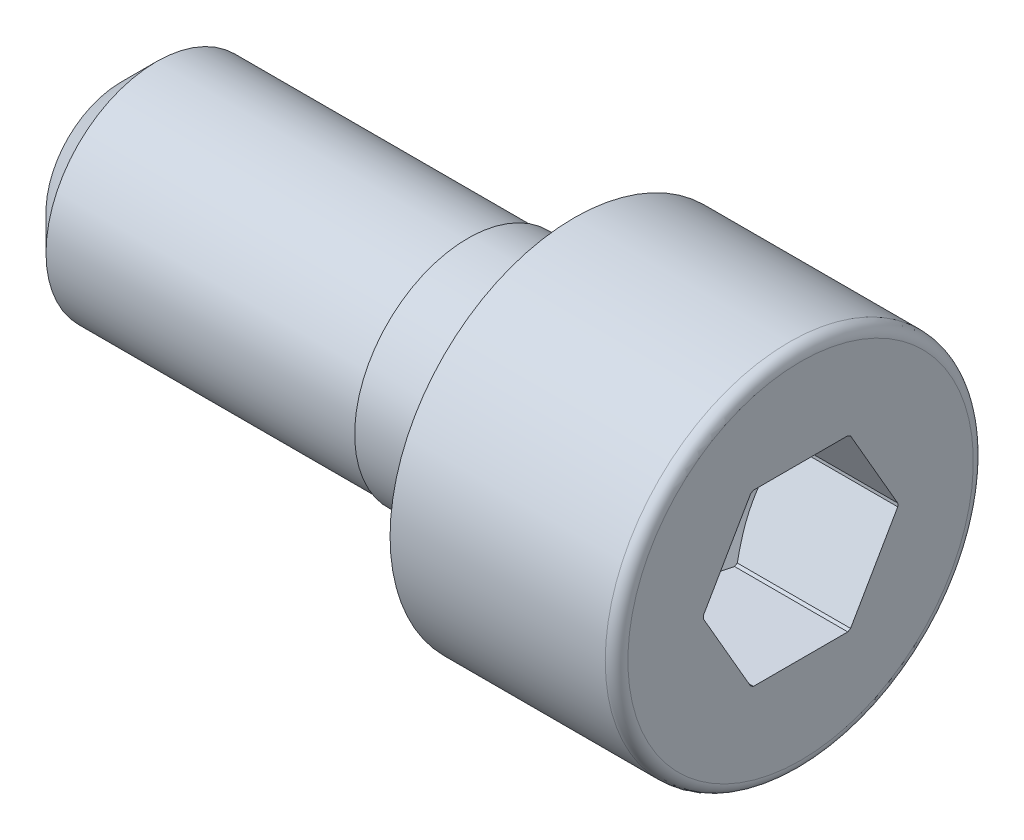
ISO-10303-21;
HEADER;
FILE_DESCRIPTION(('STEP AP214'),'2;1');
FILE_NAME('part.step','',(''),(''),'','','');
FILE_SCHEMA(('AUTOMOTIVE_DESIGN { 1 0 10303 214 1 1 1 1 }'));
ENDSEC;
DATA;
#1=APPLICATION_CONTEXT('core data for automotive mechanical design processes');
#2=APPLICATION_PROTOCOL_DEFINITION('international standard','automotive_design',2000,#1);
#3=PRODUCT_CONTEXT('',#1,'mechanical');
#4=PRODUCT('Part','Part','',(#3));
#5=PRODUCT_RELATED_PRODUCT_CATEGORY('part','',(#4));
#6=PRODUCT_DEFINITION_FORMATION('','',#4);
#7=PRODUCT_DEFINITION_CONTEXT('part definition',#1,'design');
#8=PRODUCT_DEFINITION('design','',#6,#7);
#9=PRODUCT_DEFINITION_SHAPE('','',#8);
#10=(LENGTH_UNIT() NAMED_UNIT(*) SI_UNIT(.MILLI.,.METRE.));
#11=(NAMED_UNIT(*) PLANE_ANGLE_UNIT() SI_UNIT($,.RADIAN.));
#12=(NAMED_UNIT(*) SI_UNIT($,.STERADIAN.) SOLID_ANGLE_UNIT());
#13=UNCERTAINTY_MEASURE_WITH_UNIT(LENGTH_MEASURE(1.E-05),#10,'distance_accuracy_value','');
#14=(GEOMETRIC_REPRESENTATION_CONTEXT(3) GLOBAL_UNCERTAINTY_ASSIGNED_CONTEXT((#13)) GLOBAL_UNIT_ASSIGNED_CONTEXT((#10,
#11,#12)) REPRESENTATION_CONTEXT('',''));
#15=CARTESIAN_POINT('',(0.,0.,0.));
#16=DIRECTION('',(0.,0.,1.));
#17=DIRECTION('',(1.,0.,0.));
#18=AXIS2_PLACEMENT_3D('',#15,#16,#17);
#19=CARTESIAN_POINT('',(-16.,3.90243902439,0.));
#20=DIRECTION('',(1.,0.,0.));
#21=DIRECTION('',(0.,0.,-1.));
#22=AXIS2_PLACEMENT_3D('',#19,#20,#21);
#23=PLANE('',#22);
#24=CARTESIAN_POINT('',(-16.0000000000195,0.,-1.37718790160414E-13));
#25=DIRECTION('',(1.,0.,1.10521976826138E-13));
#26=DIRECTION('',(1.10521976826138E-13,0.,-1.));
#27=AXIS2_PLACEMENT_3D('',#24,#25,#26);
#28=CIRCLE('',#27,2.6524390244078);
#29=CARTESIAN_POINT('',(-16.0000000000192,0.,-2.65243902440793));
#30=VERTEX_POINT('',#29);
#31=EDGE_CURVE('E163',#30,#30,#28,.T.);
#32=ORIENTED_EDGE('',*,*,#31,.F.);
#33=EDGE_LOOP('',(#32));
#34=FACE_BOUND('',#33,.T.);
#35=ADVANCED_FACE('F16',(#34),#23,.F.);
#36=CARTESIAN_POINT('',(-14.750000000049,0.,0.));
#37=DIRECTION('',(1.,0.,1.10521976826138E-13));
#38=DIRECTION('',(1.10521976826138E-13,0.,-1.));
#39=AXIS2_PLACEMENT_3D('',#36,#37,#38);
#40=CONICAL_SURFACE('',#39,3.90243902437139,0.7853981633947);
#41=ORIENTED_EDGE('',*,*,#31,.T.);
#42=EDGE_LOOP('',(#41));
#43=FACE_BOUND('',#42,.T.);
#44=CARTESIAN_POINT('',(-14.75,0.,0.));
#45=DIRECTION('',(1.,0.,0.));
#46=DIRECTION('',(0.,0.,-1.));
#47=AXIS2_PLACEMENT_3D('',#44,#45,#46);
#48=CIRCLE('',#47,3.90243902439);
#49=CARTESIAN_POINT('',(-14.75,0.,-3.90243902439));
#50=VERTEX_POINT('',#49);
#51=EDGE_CURVE('E160',#50,#50,#48,.T.);
#52=ORIENTED_EDGE('',*,*,#51,.F.);
#53=EDGE_LOOP('',(#52));
#54=FACE_BOUND('',#53,.T.);
#55=ADVANCED_FACE('F567',(#43,#54),#40,.T.);
#56=CARTESIAN_POINT('',(-8.,0.,0.));
#57=DIRECTION('',(1.,0.,0.));
#58=DIRECTION('',(0.,0.,-1.));
#59=AXIS2_PLACEMENT_3D('',#56,#57,#58);
#60=CYLINDRICAL_SURFACE('',#59,3.90243902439);
#61=CARTESIAN_POINT('',(-3.75,0.,0.));
#62=DIRECTION('',(1.,0.,0.));
#63=DIRECTION('',(0.,0.,-1.));
#64=AXIS2_PLACEMENT_3D('',#61,#62,#63);
#65=CIRCLE('',#64,3.90243902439);
#66=CARTESIAN_POINT('',(-3.75,0.,-3.90243902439));
#67=VERTEX_POINT('',#66);
#68=EDGE_CURVE('E133',#67,#67,#65,.F.);
#69=ORIENTED_EDGE('',*,*,#68,.T.);
#70=EDGE_LOOP('',(#69));
#71=FACE_BOUND('',#70,.T.);
#72=ORIENTED_EDGE('',*,*,#51,.T.);
#73=EDGE_LOOP('',(#72));
#74=FACE_BOUND('',#73,.T.);
#75=ADVANCED_FACE('F558',(#71,#74),#60,.T.);
#76=CARTESIAN_POINT('',(-3.75,4.,0.));
#77=DIRECTION('',(1.,0.,0.));
#78=DIRECTION('',(0.,0.,-1.));
#79=AXIS2_PLACEMENT_3D('',#76,#77,#78);
#80=PLANE('',#79);
#81=ORIENTED_EDGE('',*,*,#68,.F.);
#82=EDGE_LOOP('',(#81));
#83=FACE_BOUND('',#82,.T.);
#84=CARTESIAN_POINT('',(-3.75,0.,0.));
#85=DIRECTION('',(1.,0.,0.));
#86=DIRECTION('',(0.,0.,-1.));
#87=AXIS2_PLACEMENT_3D('',#84,#85,#86);
#88=CIRCLE('',#87,4.);
#89=CARTESIAN_POINT('',(-3.75,0.,-4.));
#90=VERTEX_POINT('',#89);
#91=EDGE_CURVE('E245',#90,#90,#88,.T.);
#92=ORIENTED_EDGE('',*,*,#91,.F.);
#93=EDGE_LOOP('',(#92));
#94=FACE_BOUND('',#93,.T.);
#95=ADVANCED_FACE('F550',(#83,#94),#80,.F.);
#96=CARTESIAN_POINT('',(5.00941127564,0.,0.));
#97=DIRECTION('',(-1.,0.,0.));
#98=DIRECTION('',(0.,0.,1.));
#99=AXIS2_PLACEMENT_3D('',#96,#97,#98);
#100=CYLINDRICAL_SURFACE('',#99,3.4315);
#101=DIRECTION('',(1.,0.,0.));
#102=VECTOR('',#101,1.);
#103=CARTESIAN_POINT('',(8.,3.,-1.66589082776));
#104=LINE('',#103,#102);
#105=CARTESIAN_POINT('',(4.00000000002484,3.,-1.66589082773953));
#106=VERTEX_POINT('',#105);
#107=CARTESIAN_POINT('',(8.,3.,-1.66589082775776));
#108=VERTEX_POINT('',#107);
#109=EDGE_CURVE('E143',#106,#108,#104,.T.);
#110=ORIENTED_EDGE('',*,*,#109,.F.);
#111=CARTESIAN_POINT('',(4.0000000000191,0.,0.));
#112=DIRECTION('',(1.,0.,0.));
#113=DIRECTION('',(0.,0.479425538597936,0.877582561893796));
#114=AXIS2_PLACEMENT_3D('',#111,#112,#113);
#115=CIRCLE('',#114,3.43149999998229);
#116=CARTESIAN_POINT('',(4.0000000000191,2.94270377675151,-1.76513079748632));
#117=VERTEX_POINT('',#116);
#118=EDGE_CURVE('E138',#106,#117,#115,.F.);
#119=ORIENTED_EDGE('',*,*,#118,.T.);
#120=DIRECTION('',(1.,0.,0.));
#121=VECTOR('',#120,1.);
#122=CARTESIAN_POINT('',(8.,2.94270377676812,-1.76513079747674));
#123=LINE('',#122,#121);
#124=CARTESIAN_POINT('',(8.,2.94270377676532,-1.76513079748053));
#125=VERTEX_POINT('',#124);
#126=EDGE_CURVE('E136',#125,#117,#123,.F.);
#127=ORIENTED_EDGE('',*,*,#126,.F.);
#128=CARTESIAN_POINT('',(8.,0.,0.));
#129=DIRECTION('',(1.,0.,0.));
#130=DIRECTION('',(0.,0.,-1.));
#131=AXIS2_PLACEMENT_3D('',#128,#129,#130);
#132=CIRCLE('',#131,3.4315);
#133=EDGE_CURVE('E120',#108,#125,#132,.F.);
#134=ORIENTED_EDGE('',*,*,#133,.F.);
#135=EDGE_LOOP('',(#110,#119,#127,#134));
#136=FACE_BOUND('',#135,.T.);
#137=ADVANCED_FACE('F137',(#136),#100,.F.);
#138=CARTESIAN_POINT('',(5.00941127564,0.,0.));
#139=DIRECTION('',(-1.,0.,0.));
#140=DIRECTION('',(0.,0.,1.));
#141=AXIS2_PLACEMENT_3D('',#138,#139,#140);
#142=CYLINDRICAL_SURFACE('',#141,3.4315);
#143=DIRECTION('',(1.,0.,0.));
#144=VECTOR('',#143,1.);
#145=CARTESIAN_POINT('',(8.,-0.0572962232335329,-3.43102162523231));
#146=LINE('',#145,#144);
#147=CARTESIAN_POINT('',(8.,-0.057296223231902,-3.43102162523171));
#148=VERTEX_POINT('',#147);
#149=CARTESIAN_POINT('',(4.0000000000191,-0.0572962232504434,-3.43102162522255));
#150=VERTEX_POINT('',#149);
#151=EDGE_CURVE('E370',#148,#150,#146,.F.);
#152=ORIENTED_EDGE('',*,*,#151,.F.);
#153=CARTESIAN_POINT('',(8.,0.,0.));
#154=DIRECTION('',(1.,0.,0.));
#155=DIRECTION('',(0.,0.,-1.));
#156=AXIS2_PLACEMENT_3D('',#153,#154,#155);
#157=CIRCLE('',#156,3.4315);
#158=CARTESIAN_POINT('',(8.,0.0572962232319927,-3.43102162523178));
#159=VERTEX_POINT('',#158);
#160=EDGE_CURVE('E132',#159,#148,#157,.F.);
#161=ORIENTED_EDGE('',*,*,#160,.F.);
#162=DIRECTION('',(1.,0.,0.));
#163=VECTOR('',#162,1.);
#164=CARTESIAN_POINT('',(8.,0.0572962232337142,-3.43102162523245));
#165=LINE('',#164,#163);
#166=CARTESIAN_POINT('',(4.00000000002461,0.0572962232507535,-3.43102162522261));
#167=VERTEX_POINT('',#166);
#168=EDGE_CURVE('E148',#167,#159,#165,.T.);
#169=ORIENTED_EDGE('',*,*,#168,.F.);
#170=CARTESIAN_POINT('',(4.0000000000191,0.,0.));
#171=DIRECTION('',(1.,0.,0.));
#172=DIRECTION('',(0.,0.479425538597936,0.877582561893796));
#173=AXIS2_PLACEMENT_3D('',#170,#171,#172);
#174=CIRCLE('',#173,3.43149999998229);
#175=EDGE_CURVE('E157',#167,#150,#174,.F.);
#176=ORIENTED_EDGE('',*,*,#175,.T.);
#177=EDGE_LOOP('',(#152,#161,#169,#176));
#178=FACE_BOUND('',#177,.T.);
#179=ADVANCED_FACE('F406',(#178),#142,.F.);
#180=CARTESIAN_POINT('',(5.00941127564,0.,0.));
#181=DIRECTION('',(-1.,0.,0.));
#182=DIRECTION('',(0.,0.,1.));
#183=AXIS2_PLACEMENT_3D('',#180,#181,#182);
#184=CYLINDRICAL_SURFACE('',#183,3.4315);
#185=CARTESIAN_POINT('',(4.0000000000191,0.,0.));
#186=DIRECTION('',(1.,0.,0.));
#187=DIRECTION('',(0.,0.479425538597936,0.877582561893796));
#188=AXIS2_PLACEMENT_3D('',#185,#186,#187);
#189=CIRCLE('',#188,3.43149999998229);
#190=CARTESIAN_POINT('',(4.00000000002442,-2.94270377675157,-1.76513079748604));
#191=VERTEX_POINT('',#190);
#192=CARTESIAN_POINT('',(4.0000000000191,-3.,-1.66589082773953));
#193=VERTEX_POINT('',#192);
#194=EDGE_CURVE('E253',#191,#193,#189,.F.);
#195=ORIENTED_EDGE('',*,*,#194,.T.);
#196=DIRECTION('',(1.,0.,0.));
#197=VECTOR('',#196,1.);
#198=CARTESIAN_POINT('',(8.,-3.,-1.66589082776));
#199=LINE('',#198,#197);
#200=CARTESIAN_POINT('',(8.,-3.,-1.66589082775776));
#201=VERTEX_POINT('',#200);
#202=EDGE_CURVE('E219',#201,#193,#199,.F.);
#203=ORIENTED_EDGE('',*,*,#202,.F.);
#204=CARTESIAN_POINT('',(8.,0.,0.));
#205=DIRECTION('',(1.,0.,0.));
#206=DIRECTION('',(0.,0.,-1.));
#207=AXIS2_PLACEMENT_3D('',#204,#205,#206);
#208=CIRCLE('',#207,3.4315);
#209=CARTESIAN_POINT('',(8.,-2.94270377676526,-1.76513079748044));
#210=VERTEX_POINT('',#209);
#211=EDGE_CURVE('E256',#210,#201,#208,.F.);
#212=ORIENTED_EDGE('',*,*,#211,.F.);
#213=DIRECTION('',(1.,0.,0.));
#214=VECTOR('',#213,1.);
#215=CARTESIAN_POINT('',(8.,-2.94270377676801,-1.76513079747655));
#216=LINE('',#215,#214);
#217=EDGE_CURVE('E367',#191,#210,#216,.T.);
#218=ORIENTED_EDGE('',*,*,#217,.F.);
#219=EDGE_LOOP('',(#195,#203,#212,#218));
#220=FACE_BOUND('',#219,.T.);
#221=ADVANCED_FACE('F395',(#220),#184,.F.);
#222=CARTESIAN_POINT('',(5.00941127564,0.,0.));
#223=DIRECTION('',(-1.,0.,0.));
#224=DIRECTION('',(0.,0.,1.));
#225=AXIS2_PLACEMENT_3D('',#222,#223,#224);
#226=CYLINDRICAL_SURFACE('',#225,3.4315);
#227=DIRECTION('',(1.,0.,0.));
#228=VECTOR('',#227,1.);
#229=CARTESIAN_POINT('',(8.,-3.,1.66589082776));
#230=LINE('',#229,#228);
#231=CARTESIAN_POINT('',(4.00000000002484,-3.,1.66589082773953));
#232=VERTEX_POINT('',#231);
#233=CARTESIAN_POINT('',(8.,-3.,1.66589082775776));
#234=VERTEX_POINT('',#233);
#235=EDGE_CURVE('E218',#232,#234,#230,.T.);
#236=ORIENTED_EDGE('',*,*,#235,.F.);
#237=CARTESIAN_POINT('',(4.0000000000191,0.,0.));
#238=DIRECTION('',(1.,0.,0.));
#239=DIRECTION('',(0.,0.479425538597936,0.877582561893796));
#240=AXIS2_PLACEMENT_3D('',#237,#238,#239);
#241=CIRCLE('',#240,3.43149999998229);
#242=CARTESIAN_POINT('',(4.0000000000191,-2.94270377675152,1.76513079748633));
#243=VERTEX_POINT('',#242);
#244=EDGE_CURVE('E385',#232,#243,#241,.F.);
#245=ORIENTED_EDGE('',*,*,#244,.T.);
#246=DIRECTION('',(1.,0.,0.));
#247=VECTOR('',#246,1.);
#248=CARTESIAN_POINT('',(8.,-2.94270377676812,1.76513079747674));
#249=LINE('',#248,#247);
#250=CARTESIAN_POINT('',(8.,-2.94270377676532,1.76513079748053));
#251=VERTEX_POINT('',#250);
#252=EDGE_CURVE('E360',#251,#243,#249,.F.);
#253=ORIENTED_EDGE('',*,*,#252,.F.);
#254=CARTESIAN_POINT('',(8.,0.,0.));
#255=DIRECTION('',(1.,0.,0.));
#256=DIRECTION('',(0.,0.,-1.));
#257=AXIS2_PLACEMENT_3D('',#254,#255,#256);
#258=CIRCLE('',#257,3.4315);
#259=EDGE_CURVE('E254',#234,#251,#258,.F.);
#260=ORIENTED_EDGE('',*,*,#259,.F.);
#261=EDGE_LOOP('',(#236,#245,#253,#260));
#262=FACE_BOUND('',#261,.T.);
#263=ADVANCED_FACE('F420',(#262),#226,.F.);
#264=CARTESIAN_POINT('',(5.00941127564,0.,0.));
#265=DIRECTION('',(-1.,0.,0.));
#266=DIRECTION('',(0.,0.,1.));
#267=AXIS2_PLACEMENT_3D('',#264,#265,#266);
#268=CYLINDRICAL_SURFACE('',#267,3.4315);
#269=DIRECTION('',(1.,0.,0.));
#270=VECTOR('',#269,1.);
#271=CARTESIAN_POINT('',(8.,0.0572962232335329,3.43102162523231));
#272=LINE('',#271,#270);
#273=CARTESIAN_POINT('',(8.,0.057296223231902,3.43102162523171));
#274=VERTEX_POINT('',#273);
#275=CARTESIAN_POINT('',(4.0000000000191,0.0572962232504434,3.43102162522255));
#276=VERTEX_POINT('',#275);
#277=EDGE_CURVE('E176',#274,#276,#272,.F.);
#278=ORIENTED_EDGE('',*,*,#277,.F.);
#279=CARTESIAN_POINT('',(8.,0.,0.));
#280=DIRECTION('',(1.,0.,0.));
#281=DIRECTION('',(0.,0.,-1.));
#282=AXIS2_PLACEMENT_3D('',#279,#280,#281);
#283=CIRCLE('',#282,3.4315);
#284=CARTESIAN_POINT('',(8.,-0.0572962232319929,3.43102162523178));
#285=VERTEX_POINT('',#284);
#286=EDGE_CURVE('E251',#285,#274,#283,.F.);
#287=ORIENTED_EDGE('',*,*,#286,.F.);
#288=DIRECTION('',(1.,0.,0.));
#289=VECTOR('',#288,1.);
#290=CARTESIAN_POINT('',(8.,-0.0572962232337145,3.43102162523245));
#291=LINE('',#290,#289);
#292=CARTESIAN_POINT('',(4.00000000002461,-0.057296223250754,3.43102162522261));
#293=VERTEX_POINT('',#292);
#294=EDGE_CURVE('E357',#293,#285,#291,.T.);
#295=ORIENTED_EDGE('',*,*,#294,.F.);
#296=CARTESIAN_POINT('',(4.0000000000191,0.,0.));
#297=DIRECTION('',(1.,0.,0.));
#298=DIRECTION('',(0.,0.479425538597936,0.877582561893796));
#299=AXIS2_PLACEMENT_3D('',#296,#297,#298);
#300=CIRCLE('',#299,3.43149999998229);
#301=EDGE_CURVE('E158',#293,#276,#300,.F.);
#302=ORIENTED_EDGE('',*,*,#301,.T.);
#303=EDGE_LOOP('',(#278,#287,#295,#302));
#304=FACE_BOUND('',#303,.T.);
#305=ADVANCED_FACE('F191',(#304),#268,.F.);
#306=CARTESIAN_POINT('',(4.0000000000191,0.,0.));
#307=DIRECTION('',(1.,0.,0.));
#308=DIRECTION('',(0.,0.,-1.));
#309=AXIS2_PLACEMENT_3D('',#306,#307,#308);
#310=CONICAL_SURFACE('',#309,3.43149999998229,1.0471975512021);
#311=CARTESIAN_POINT('',(2.02219020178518,-3.92209341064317E-12,2.14264945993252E-12));
#312=VERTEX_POINT('',#311);
#313=VERTEX_LOOP('',#312);
#314=FACE_BOUND('',#313,.T.);
#315=CARTESIAN_POINT('',(4.00000000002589,0.0572962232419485,3.43102162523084));
#316=CARTESIAN_POINT('',(3.96325492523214,0.17081183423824,3.36548335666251));
#317=CARTESIAN_POINT('',(3.929566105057,0.28514686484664,3.29947199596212));
#318=CARTESIAN_POINT('',(3.86970967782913,0.515490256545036,3.16648317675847));
#319=CARTESIAN_POINT('',(3.8435558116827,0.631501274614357,3.09950418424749));
#320=CARTESIAN_POINT('',(3.80077359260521,0.862380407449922,2.96620605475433));
#321=CARTESIAN_POINT('',(3.78395759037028,0.977221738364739,2.899902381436));
#322=CARTESIAN_POINT('',(3.76016083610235,1.20757941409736,2.76690531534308));
#323=CARTESIAN_POINT('',(3.75317159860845,1.32309508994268,2.70021230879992));
#324=CARTESIAN_POINT('',(3.74938304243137,1.56424529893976,2.56098417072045));
#325=CARTESIAN_POINT('',(3.75351627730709,1.68989180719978,2.48844212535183));
#326=CARTESIAN_POINT('',(3.77363673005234,1.94058202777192,2.34370605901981));
#327=CARTESIAN_POINT('',(3.78963616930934,2.06562498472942,2.2715124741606));
#328=CARTESIAN_POINT('',(3.83267808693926,2.31719015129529,2.1262712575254));
#329=CARTESIAN_POINT('',(3.85996753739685,2.4436796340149,2.05324252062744));
#330=CARTESIAN_POINT('',(3.92364198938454,2.69467514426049,1.90833019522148));
#331=CARTESIAN_POINT('',(3.96000827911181,2.81918469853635,1.83644457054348));
#332=CARTESIAN_POINT('',(4.00000000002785,2.94270377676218,1.76513079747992));
#333=B_SPLINE_CURVE_WITH_KNOTS('',3,(#315,#316,#317,#318,#319,#320,#321,#322,#323,#324,#325,
#326,#327,#328,#329,#330,#331,#332),.UNSPECIFIED.,.F.,.F.,(4,2,2,2,2,2,2,2,4),(0.,
0.408481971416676,0.817704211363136,1.21837417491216,1.61869794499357,2.05360864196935,
2.48896789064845,2.93440148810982,3.3789243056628),.UNSPECIFIED.);
#334=CARTESIAN_POINT('',(4.00000000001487,2.94270377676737,1.76513079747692));
#335=VERTEX_POINT('',#334);
#336=EDGE_CURVE('E167',#276,#335,#333,.T.);
#337=ORIENTED_EDGE('',*,*,#336,.F.);
#338=ORIENTED_EDGE('',*,*,#301,.F.);
#339=CARTESIAN_POINT('',(4.00000000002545,-2.94270377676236,1.76513079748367));
#340=CARTESIAN_POINT('',(3.95761571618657,-2.8118234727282,1.84069457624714));
#341=CARTESIAN_POINT('',(3.9193099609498,-2.67981268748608,1.9169110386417));
#342=CARTESIAN_POINT('',(3.85299680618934,-2.41358638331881,2.07061686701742));
#343=CARTESIAN_POINT('',(3.82501189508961,-2.27936670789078,2.14810863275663));
#344=CARTESIAN_POINT('',(3.78220050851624,-2.01256396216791,2.30214726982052));
#345=CARTESIAN_POINT('',(3.76707654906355,-1.88001803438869,2.37867269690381));
#346=CARTESIAN_POINT('',(3.75031731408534,-1.61441682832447,2.53201762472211));
#347=CARTESIAN_POINT('',(3.74866675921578,-1.4813622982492,2.60883669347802));
#348=CARTESIAN_POINT('',(3.75800702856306,-1.240344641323,2.7479883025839));
#349=CARTESIAN_POINT('',(3.76670796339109,-1.13230895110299,2.81036273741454));
#350=CARTESIAN_POINT('',(3.79254998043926,-0.916926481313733,2.93471386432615));
#351=CARTESIAN_POINT('',(3.80969720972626,-0.809580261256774,2.99669023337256));
#352=CARTESIAN_POINT('',(3.8518773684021,-0.593876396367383,3.12122691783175));
#353=CARTESIAN_POINT('',(3.8770609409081,-0.485541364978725,3.18377417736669));
#354=CARTESIAN_POINT('',(3.93394629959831,-0.270335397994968,3.30802340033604));
#355=CARTESIAN_POINT('',(3.96563762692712,-0.163462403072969,3.36972655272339));
#356=CARTESIAN_POINT('',(4.00000000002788,-0.0572962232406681,3.43102162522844));
#357=B_SPLINE_CURVE_WITH_KNOTS('',3,(#339,#340,#341,#342,#343,#344,#345,#346,#347,#348,#349,
#350,#351,#352,#353,#354,#355,#356),.UNSPECIFIED.,.F.,.F.,(4,2,2,2,2,2,2,2,4),(0.,
0.471055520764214,0.943131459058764,1.40396540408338,1.86427667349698,2.23913478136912,
2.61426610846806,2.99688901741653,3.37890174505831),.UNSPECIFIED.);
#358=EDGE_CURVE('E177',#243,#293,#357,.T.);
#359=ORIENTED_EDGE('',*,*,#358,.F.);
#360=ORIENTED_EDGE('',*,*,#244,.F.);
#361=CARTESIAN_POINT('',(4.00000000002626,-3.000000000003,-1.66589082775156));
#362=CARTESIAN_POINT('',(3.95761571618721,-3.00000000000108,-1.51476327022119));
#363=CARTESIAN_POINT('',(3.91930996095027,-3.00000000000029,-1.36233034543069));
#364=CARTESIAN_POINT('',(3.85299680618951,-2.99999999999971,-1.05491868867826));
#365=CARTESIAN_POINT('',(3.82501189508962,-2.99999999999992,-0.899935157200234));
#366=CARTESIAN_POINT('',(3.78220050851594,-3.00000000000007,-0.591857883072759));
#367=CARTESIAN_POINT('',(3.76707654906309,-3.00000000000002,-0.438807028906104));
#368=CARTESIAN_POINT('',(3.75031731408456,-2.99999999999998,-0.132117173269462));
#369=CARTESIAN_POINT('',(3.74866675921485,-2.99999999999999,0.0215209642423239));
#370=CARTESIAN_POINT('',(3.75800702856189,-3.,0.299824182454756));
#371=CARTESIAN_POINT('',(3.76670796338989,-3.,0.424573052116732));
#372=CARTESIAN_POINT('',(3.79254998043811,-3.,0.673275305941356));
#373=CARTESIAN_POINT('',(3.80969720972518,-3.,0.797228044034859));
#374=CARTESIAN_POINT('',(3.85187736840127,-3.,1.04630141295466));
#375=CARTESIAN_POINT('',(3.87706094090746,-3.,1.17139593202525));
#376=CARTESIAN_POINT('',(3.93394629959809,-3.,1.41989437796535));
#377=CARTESIAN_POINT('',(3.96563762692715,-3.,1.54330068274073));
#378=CARTESIAN_POINT('',(4.00000000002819,-3.,1.6658908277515));
#379=B_SPLINE_CURVE_WITH_KNOTS('',3,(#361,#362,#363,#364,#365,#366,#367,#368,#369,#370,#371,
#372,#373,#374,#375,#376,#377,#378),.UNSPECIFIED.,.F.,.F.,(4,2,2,2,2,2,2,2,4),(0.,
0.471055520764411,0.943131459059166,1.40396540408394,1.86427667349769,2.23913478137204,
2.61426610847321,2.99688901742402,3.37890174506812),.UNSPECIFIED.);
#380=EDGE_CURVE('E212',#193,#232,#379,.T.);
#381=ORIENTED_EDGE('',*,*,#380,.F.);
#382=ORIENTED_EDGE('',*,*,#194,.F.);
#383=CARTESIAN_POINT('',(4.00000000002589,-0.0572962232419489,-3.43102162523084));
#384=CARTESIAN_POINT('',(3.96325492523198,-0.170811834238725,-3.36548335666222));
#385=CARTESIAN_POINT('',(3.92956610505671,-0.285146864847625,-3.29947199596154));
#386=CARTESIAN_POINT('',(3.86970967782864,-0.515490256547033,-3.16648317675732));
#387=CARTESIAN_POINT('',(3.84355581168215,-0.631501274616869,-3.09950418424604));
#388=CARTESIAN_POINT('',(3.80077359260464,-0.862380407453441,-2.96620605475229));
#389=CARTESIAN_POINT('',(3.78395759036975,-0.977221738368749,-2.89990238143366));
#390=CARTESIAN_POINT('',(3.76016083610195,-1.20757941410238,-2.7669053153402));
#391=CARTESIAN_POINT('',(3.75317159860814,-1.32309508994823,-2.70021230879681));
#392=CARTESIAN_POINT('',(3.74938304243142,-1.5642452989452,-2.56098417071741));
#393=CARTESIAN_POINT('',(3.75351627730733,-1.68989180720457,-2.4884421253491));
#394=CARTESIAN_POINT('',(3.77363673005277,-1.94058202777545,-2.34370605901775));
#395=CARTESIAN_POINT('',(3.78963616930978,-2.06562498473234,-2.27151247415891));
#396=CARTESIAN_POINT('',(3.83267808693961,-2.31719015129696,-2.12627125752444));
#397=CARTESIAN_POINT('',(3.8599675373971,-2.44367963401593,-2.05324252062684));
#398=CARTESIAN_POINT('',(3.92364198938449,-2.69467514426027,-1.9083301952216));
#399=CARTESIAN_POINT('',(3.96000827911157,-2.81918469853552,-1.83644457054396));
#400=CARTESIAN_POINT('',(4.00000000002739,-2.94270377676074,-1.76513079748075));
#401=B_SPLINE_CURVE_WITH_KNOTS('',3,(#383,#384,#385,#386,#387,#388,#389,#390,#391,#392,#393,
#394,#395,#396,#397,#398,#399,#400),.UNSPECIFIED.,.F.,.F.,(4,2,2,2,2,2,2,2,4),(0.,
0.408481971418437,0.817704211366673,1.2183741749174,1.6186979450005,2.05360864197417,
2.48896789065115,2.93440148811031,3.37892430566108),.UNSPECIFIED.);
#402=EDGE_CURVE('E207',#150,#191,#401,.T.);
#403=ORIENTED_EDGE('',*,*,#402,.F.);
#404=ORIENTED_EDGE('',*,*,#175,.F.);
#405=CARTESIAN_POINT('',(4.00000000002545,2.94270377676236,-1.76513079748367));
#406=CARTESIAN_POINT('',(3.95761571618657,2.8118234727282,-1.84069457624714));
#407=CARTESIAN_POINT('',(3.91930996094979,2.67981268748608,-1.9169110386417));
#408=CARTESIAN_POINT('',(3.85299680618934,2.41358638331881,-2.07061686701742));
#409=CARTESIAN_POINT('',(3.82501189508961,2.27936670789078,-2.14810863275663));
#410=CARTESIAN_POINT('',(3.78220050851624,2.0125639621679,-2.30214726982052));
#411=CARTESIAN_POINT('',(3.76707654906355,1.88001803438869,-2.37867269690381));
#412=CARTESIAN_POINT('',(3.75031731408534,1.61441682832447,-2.53201762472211));
#413=CARTESIAN_POINT('',(3.74866675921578,1.4813622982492,-2.60883669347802));
#414=CARTESIAN_POINT('',(3.75800702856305,1.240344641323,-2.7479883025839));
#415=CARTESIAN_POINT('',(3.76670796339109,1.13230895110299,-2.81036273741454));
#416=CARTESIAN_POINT('',(3.79254998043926,0.916926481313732,-2.93471386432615));
#417=CARTESIAN_POINT('',(3.80969720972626,0.809580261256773,-2.99669023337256));
#418=CARTESIAN_POINT('',(3.8518773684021,0.593876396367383,-3.12122691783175));
#419=CARTESIAN_POINT('',(3.8770609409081,0.485541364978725,-3.18377417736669));
#420=CARTESIAN_POINT('',(3.93394629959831,0.270335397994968,-3.30802340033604));
#421=CARTESIAN_POINT('',(3.96563762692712,0.163462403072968,-3.36972655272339));
#422=CARTESIAN_POINT('',(4.00000000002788,0.0572962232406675,-3.43102162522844));
#423=B_SPLINE_CURVE_WITH_KNOTS('',3,(#405,#406,#407,#408,#409,#410,#411,#412,#413,#414,#415,
#416,#417,#418,#419,#420,#421,#422),.UNSPECIFIED.,.F.,.F.,(4,2,2,2,2,2,2,2,4),(0.,
0.471055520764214,0.943131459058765,1.40396540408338,1.86427667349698,2.23913478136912,
2.61426610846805,2.99688901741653,3.37890174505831),.UNSPECIFIED.);
#424=EDGE_CURVE('E142',#117,#167,#423,.T.);
#425=ORIENTED_EDGE('',*,*,#424,.F.);
#426=ORIENTED_EDGE('',*,*,#118,.F.);
#427=CARTESIAN_POINT('',(4.00000000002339,3.00000000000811,1.66589082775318));
#428=CARTESIAN_POINT('',(3.95761571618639,3.00000000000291,1.51476327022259));
#429=CARTESIAN_POINT('',(3.91930996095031,3.00000000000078,1.36233034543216));
#430=CARTESIAN_POINT('',(3.85299680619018,2.99999999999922,1.05491868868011));
#431=CARTESIAN_POINT('',(3.82501189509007,2.99999999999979,0.899935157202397));
#432=CARTESIAN_POINT('',(3.78220050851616,3.0000000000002,0.591857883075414));
#433=CARTESIAN_POINT('',(3.76707654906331,3.00000000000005,0.438807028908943));
#434=CARTESIAN_POINT('',(3.75031731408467,2.99999999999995,0.132117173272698));
#435=CARTESIAN_POINT('',(3.74866675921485,2.99999999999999,-0.021520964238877));
#436=CARTESIAN_POINT('',(3.75800702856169,3.00000000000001,-0.299824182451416));
#437=CARTESIAN_POINT('',(3.76670796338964,3.,-0.424573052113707));
#438=CARTESIAN_POINT('',(3.7925499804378,3.,-0.673275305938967));
#439=CARTESIAN_POINT('',(3.80969720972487,3.,-0.797228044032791));
#440=CARTESIAN_POINT('',(3.85187736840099,3.,-1.04630141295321));
#441=CARTESIAN_POINT('',(3.87706094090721,3.,-1.1713959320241));
#442=CARTESIAN_POINT('',(3.93394629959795,3.,-1.41989437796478));
#443=CARTESIAN_POINT('',(3.96563762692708,3.,-1.54330068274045));
#444=CARTESIAN_POINT('',(4.00000000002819,3.,-1.6658908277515));
#445=B_SPLINE_CURVE_WITH_KNOTS('',3,(#427,#428,#429,#430,#431,#432,#433,#434,#435,#436,#437,
#438,#439,#440,#441,#442,#443,#444),.UNSPECIFIED.,.F.,.F.,(4,2,2,2,2,2,2,2,4),(0.,
0.471055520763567,0.943131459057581,1.40396540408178,1.86427667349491,2.23913478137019,
2.61426610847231,2.99688901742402,3.378901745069),.UNSPECIFIED.);
#446=CARTESIAN_POINT('',(4.00000000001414,3.,1.6658908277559));
#447=VERTEX_POINT('',#446);
#448=EDGE_CURVE('E238',#447,#106,#445,.T.);
#449=ORIENTED_EDGE('',*,*,#448,.F.);
#450=CARTESIAN_POINT('',(4.,0.,0.));
#451=DIRECTION('',(-1.,0.,0.));
#452=DIRECTION('',(0.,0.,1.));
#453=AXIS2_PLACEMENT_3D('',#450,#451,#452);
#454=CIRCLE('',#453,3.4315);
#455=EDGE_CURVE('E248',#447,#335,#454,.F.);
#456=ORIENTED_EDGE('',*,*,#455,.T.);
#457=EDGE_LOOP('',(#337,#338,#359,#360,#381,#382,#403,#404,#425,#426,#449,#456));
#458=FACE_BOUND('',#457,.T.);
#459=ADVANCED_FACE('F185',(#314,#458),#310,.F.);
#460=CARTESIAN_POINT('',(5.00941127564,0.,0.));
#461=DIRECTION('',(-1.,0.,0.));
#462=DIRECTION('',(0.,0.,1.));
#463=AXIS2_PLACEMENT_3D('',#460,#461,#462);
#464=CYLINDRICAL_SURFACE('',#463,3.4315);
#465=ORIENTED_EDGE('',*,*,#455,.F.);
#466=DIRECTION('',(1.,0.,0.));
#467=VECTOR('',#466,1.);
#468=CARTESIAN_POINT('',(8.,3.,1.66589082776));
#469=LINE('',#468,#467);
#470=CARTESIAN_POINT('',(8.,3.,1.66589082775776));
#471=VERTEX_POINT('',#470);
#472=EDGE_CURVE('E244',#471,#447,#469,.F.);
#473=ORIENTED_EDGE('',*,*,#472,.F.);
#474=CARTESIAN_POINT('',(8.,0.,0.));
#475=DIRECTION('',(1.,0.,0.));
#476=DIRECTION('',(0.,0.,-1.));
#477=AXIS2_PLACEMENT_3D('',#474,#475,#476);
#478=CIRCLE('',#477,3.4315);
#479=CARTESIAN_POINT('',(8.,2.94270377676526,1.76513079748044));
#480=VERTEX_POINT('',#479);
#481=EDGE_CURVE('E249',#480,#471,#478,.F.);
#482=ORIENTED_EDGE('',*,*,#481,.F.);
#483=DIRECTION('',(1.,0.,0.));
#484=VECTOR('',#483,1.);
#485=CARTESIAN_POINT('',(8.,2.94270377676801,1.76513079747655));
#486=LINE('',#485,#484);
#487=EDGE_CURVE('E175',#335,#480,#486,.T.);
#488=ORIENTED_EDGE('',*,*,#487,.F.);
#489=EDGE_LOOP('',(#465,#473,#482,#488));
#490=FACE_BOUND('',#489,.T.);
#491=ADVANCED_FACE('F190',(#490),#464,.F.);
#492=CARTESIAN_POINT('',(-8.,0.,0.));
#493=DIRECTION('',(1.,0.,0.));
#494=DIRECTION('',(0.,0.,-1.));
#495=AXIS2_PLACEMENT_3D('',#492,#493,#494);
#496=CYLINDRICAL_SURFACE('',#495,4.);
#497=ORIENTED_EDGE('',*,*,#91,.T.);
#498=EDGE_LOOP('',(#497));
#499=FACE_BOUND('',#498,.T.);
#500=CARTESIAN_POINT('',(-0.4,0.,0.));
#501=DIRECTION('',(1.,0.,0.));
#502=DIRECTION('',(0.,-0.997363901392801,-0.0725620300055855));
#503=AXIS2_PLACEMENT_3D('',#500,#501,#502);
#504=CIRCLE('',#503,4.);
#505=CARTESIAN_POINT('',(-0.4,-3.9894556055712,-0.290248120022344));
#506=VERTEX_POINT('',#505);
#507=EDGE_CURVE('E354',#506,#506,#504,.F.);
#508=ORIENTED_EDGE('',*,*,#507,.T.);
#509=EDGE_LOOP('',(#508));
#510=FACE_BOUND('',#509,.T.);
#511=ADVANCED_FACE('F236',(#499,#510),#496,.T.);
#512=CARTESIAN_POINT('',(8.,3.,-1.73205080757));
#513=DIRECTION('',(0.,-1.,0.));
#514=DIRECTION('',(0.,0.,-1.));
#515=AXIS2_PLACEMENT_3D('',#512,#513,#514);
#516=PLANE('',#515);
#517=ORIENTED_EDGE('',*,*,#448,.T.);
#518=ORIENTED_EDGE('',*,*,#109,.T.);
#519=DIRECTION('',(0.,0.,-1.));
#520=VECTOR('',#519,1.);
#521=CARTESIAN_POINT('',(8.,3.,0.));
#522=LINE('',#521,#520);
#523=EDGE_CURVE('E131',#471,#108,#522,.T.);
#524=ORIENTED_EDGE('',*,*,#523,.F.);
#525=ORIENTED_EDGE('',*,*,#472,.T.);
#526=EDGE_LOOP('',(#517,#518,#524,#525));
#527=FACE_BOUND('',#526,.T.);
#528=ADVANCED_FACE('F233',(#527),#516,.T.);
#529=CARTESIAN_POINT('',(8.,0.,-3.46410161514));
#530=DIRECTION('',(0.,-0.50000000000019,0.866025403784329));
#531=DIRECTION('',(0.,-0.866025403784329,-0.50000000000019));
#532=AXIS2_PLACEMENT_3D('',#529,#530,#531);
#533=PLANE('',#532);
#534=ORIENTED_EDGE('',*,*,#424,.T.);
#535=ORIENTED_EDGE('',*,*,#168,.T.);
#536=DIRECTION('',(0.,-0.866025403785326,-0.499999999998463));
#537=VECTOR('',#536,1.);
#538=CARTESIAN_POINT('',(8.,2.94270377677,-1.76513079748));
#539=LINE('',#538,#537);
#540=EDGE_CURVE('E129',#125,#159,#539,.T.);
#541=ORIENTED_EDGE('',*,*,#540,.F.);
#542=ORIENTED_EDGE('',*,*,#126,.T.);
#543=EDGE_LOOP('',(#534,#535,#541,#542));
#544=FACE_BOUND('',#543,.T.);
#545=ADVANCED_FACE('F146',(#544),#533,.T.);
#546=CARTESIAN_POINT('',(8.,-3.,-1.73205080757));
#547=DIRECTION('',(0.,0.50000000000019,0.866025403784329));
#548=DIRECTION('',(0.,-0.866025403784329,0.50000000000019));
#549=AXIS2_PLACEMENT_3D('',#546,#547,#548);
#550=PLANE('',#549);
#551=ORIENTED_EDGE('',*,*,#402,.T.);
#552=ORIENTED_EDGE('',*,*,#217,.T.);
#553=DIRECTION('',(0.,-0.866025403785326,0.499999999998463));
#554=VECTOR('',#553,1.);
#555=CARTESIAN_POINT('',(8.,-0.0572962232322,-3.43102162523));
#556=LINE('',#555,#554);
#557=EDGE_CURVE('E149',#148,#210,#556,.T.);
#558=ORIENTED_EDGE('',*,*,#557,.F.);
#559=ORIENTED_EDGE('',*,*,#151,.T.);
#560=EDGE_LOOP('',(#551,#552,#558,#559));
#561=FACE_BOUND('',#560,.T.);
#562=ADVANCED_FACE('F224',(#561),#550,.T.);
#563=CARTESIAN_POINT('',(8.,-3.,1.73205080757));
#564=DIRECTION('',(0.,1.,0.));
#565=DIRECTION('',(0.,0.,1.));
#566=AXIS2_PLACEMENT_3D('',#563,#564,#565);
#567=PLANE('',#566);
#568=ORIENTED_EDGE('',*,*,#380,.T.);
#569=ORIENTED_EDGE('',*,*,#235,.T.);
#570=DIRECTION('',(0.,0.,-1.));
#571=VECTOR('',#570,1.);
#572=CARTESIAN_POINT('',(8.,-3.,0.));
#573=LINE('',#572,#571);
#574=EDGE_CURVE('E152',#201,#234,#573,.F.);
#575=ORIENTED_EDGE('',*,*,#574,.F.);
#576=ORIENTED_EDGE('',*,*,#202,.T.);
#577=EDGE_LOOP('',(#568,#569,#575,#576));
#578=FACE_BOUND('',#577,.T.);
#579=ADVANCED_FACE('F220',(#578),#567,.T.);
#580=CARTESIAN_POINT('',(8.,0.,3.46410161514));
#581=DIRECTION('',(0.,0.50000000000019,-0.866025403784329));
#582=DIRECTION('',(0.,0.866025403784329,0.50000000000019));
#583=AXIS2_PLACEMENT_3D('',#580,#581,#582);
#584=PLANE('',#583);
#585=ORIENTED_EDGE('',*,*,#358,.T.);
#586=ORIENTED_EDGE('',*,*,#294,.T.);
#587=DIRECTION('',(0.,0.866025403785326,0.499999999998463));
#588=VECTOR('',#587,1.);
#589=CARTESIAN_POINT('',(8.,-2.94270377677,1.76513079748));
#590=LINE('',#589,#588);
#591=EDGE_CURVE('E382',#251,#285,#590,.T.);
#592=ORIENTED_EDGE('',*,*,#591,.F.);
#593=ORIENTED_EDGE('',*,*,#252,.T.);
#594=EDGE_LOOP('',(#585,#586,#592,#593));
#595=FACE_BOUND('',#594,.T.);
#596=ADVANCED_FACE('F223',(#595),#584,.T.);
#597=CARTESIAN_POINT('',(8.,3.,1.73205080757));
#598=DIRECTION('',(0.,-0.50000000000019,-0.866025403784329));
#599=DIRECTION('',(0.,0.866025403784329,-0.50000000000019));
#600=AXIS2_PLACEMENT_3D('',#597,#598,#599);
#601=PLANE('',#600);
#602=ORIENTED_EDGE('',*,*,#336,.T.);
#603=ORIENTED_EDGE('',*,*,#487,.T.);
#604=DIRECTION('',(0.,0.866025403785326,-0.499999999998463));
#605=VECTOR('',#604,1.);
#606=CARTESIAN_POINT('',(8.,0.0572962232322,3.43102162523));
#607=LINE('',#606,#605);
#608=EDGE_CURVE('E380',#274,#480,#607,.T.);
#609=ORIENTED_EDGE('',*,*,#608,.F.);
#610=ORIENTED_EDGE('',*,*,#277,.T.);
#611=EDGE_LOOP('',(#602,#603,#609,#610));
#612=FACE_BOUND('',#611,.T.);
#613=ADVANCED_FACE('F183',(#612),#601,.T.);
#614=CARTESIAN_POINT('',(-0.4,0.,0.));
#615=DIRECTION('',(1.,0.,0.));
#616=DIRECTION('',(0.,-0.997363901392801,-0.0725620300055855));
#617=AXIS2_PLACEMENT_3D('',#614,#615,#616);
#618=TOROIDAL_SURFACE('',#617,4.4,0.4);
#619=ORIENTED_EDGE('',*,*,#507,.F.);
#620=EDGE_LOOP('',(#619));
#621=FACE_BOUND('',#620,.T.);
#622=CARTESIAN_POINT('',(0.,0.,0.));
#623=DIRECTION('',(-1.,0.,0.));
#624=DIRECTION('',(0.,0.877582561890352,0.479425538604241));
#625=AXIS2_PLACEMENT_3D('',#622,#623,#624);
#626=CIRCLE('',#625,4.4000000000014);
#627=CARTESIAN_POINT('',(0.,3.86136327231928,2.10947236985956));
#628=VERTEX_POINT('',#627);
#629=CARTESIAN_POINT('',(0.,-3.86136327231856,-2.10947236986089));
#630=VERTEX_POINT('',#629);
#631=EDGE_CURVE('E300',#628,#630,#626,.T.);
#632=ORIENTED_EDGE('',*,*,#631,.T.);
#633=CARTESIAN_POINT('',(0.,-3.86136327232,-2.10947236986));
#634=CARTESIAN_POINT('',(-1.21326204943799E-09,-3.89670172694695,-2.04478571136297));
#635=CARTESIAN_POINT('',(1.32699964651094E-09,-3.93042770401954,-1.97921930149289));
#636=CARTESIAN_POINT('',(-7.12735846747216E-09,-3.99457332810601,-1.84649032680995));
#637=CARTESIAN_POINT('',(-1.81216944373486E-08,-4.0249930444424,-1.77932779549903));
#638=CARTESIAN_POINT('',(-7.46854945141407E-08,-4.08244629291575,-1.64356712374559));
#639=CARTESIAN_POINT('',(-1.20254996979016E-07,-4.109479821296,-1.57496898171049));
#640=CARTESIAN_POINT('',(-3.20920917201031E-07,-4.15378429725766,-1.45382914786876));
#641=CARTESIAN_POINT('',(-4.45793854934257E-07,-4.17180647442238,-1.40155985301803));
#642=CARTESIAN_POINT('',(-7.8652910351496E-07,-4.21720698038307,-1.26125175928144));
#643=CARTESIAN_POINT('',(-1.00749011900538E-06,-4.24280088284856,-1.17262518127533));
#644=CARTESIAN_POINT('',(-1.03008738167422E-06,-4.28365374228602,-1.01179618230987));
#645=CARTESIAN_POINT('',(-9.06770496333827E-07,-4.29995593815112,-0.939855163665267));
#646=CARTESIAN_POINT('',(-5.32928167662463E-07,-4.32884272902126,-0.795237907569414));
#647=CARTESIAN_POINT('',(-2.82427293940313E-07,-4.34142804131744,-0.722561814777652));
#648=CARTESIAN_POINT('',(-5.71283371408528E-08,-4.35745076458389,-0.61314434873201));
#649=CARTESIAN_POINT('',(-7.10279562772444E-09,-4.3623156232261,-0.576606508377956));
#650=CARTESIAN_POINT('',(7.61830543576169E-09,-4.37147723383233,-0.500768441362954));
#651=CARTESIAN_POINT('',(-3.41427619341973E-08,-4.37570712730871,-0.461460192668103));
#652=CARTESIAN_POINT('',(-3.66066068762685E-08,-4.38286922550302,-0.387865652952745));
#653=CARTESIAN_POINT('',(-7.1155669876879E-09,-4.38589857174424,-0.353588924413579));
#654=CARTESIAN_POINT('',(3.90583647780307E-10,-4.38977859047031,-0.301263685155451));
#655=CARTESIAN_POINT('',(-3.79577837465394E-09,-4.39098059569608,-0.283241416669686));
#656=CARTESIAN_POINT('',(-1.20997762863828E-08,-4.39467156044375,-0.222194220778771));
#657=CARTESIAN_POINT('',(-8.07975297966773E-09,-4.39663511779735,-0.179137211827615));
#658=CARTESIAN_POINT('',(-1.79925320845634E-09,-4.40006944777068,-0.0677335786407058));
#659=CARTESIAN_POINT('',(-1.95073945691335E-09,-4.4005769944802,0.00064556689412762));
#660=CARTESIAN_POINT('',(-1.07862604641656E-09,-4.39882372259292,0.111157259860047));
#661=CARTESIAN_POINT('',(-4.82991209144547E-10,-4.39754902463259,0.153308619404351));
#662=CARTESIAN_POINT('',(4.56158268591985E-12,-4.39398116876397,0.233340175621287));
#663=CARTESIAN_POINT('',(-3.90379076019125E-11,-4.39180275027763,0.271225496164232));
#664=CARTESIAN_POINT('',(-6.36075114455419E-11,-4.38558392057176,0.359540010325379));
#665=CARTESIAN_POINT('',(-1.88739875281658E-11,-4.38116496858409,0.409943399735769));
#666=CARTESIAN_POINT('',(-7.86326856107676E-10,-4.37350339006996,0.482917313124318));
#667=CARTESIAN_POINT('',(-1.14114856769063E-09,-4.37094865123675,0.505562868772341));
#668=CARTESIAN_POINT('',(-2.77955435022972E-09,-4.35854622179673,0.608298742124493));
#669=CARTESIAN_POINT('',(-4.132371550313E-09,-4.34666085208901,0.688155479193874));
#670=CARTESIAN_POINT('',(-4.79769479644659E-09,-4.31850731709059,0.84708534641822));
#671=CARTESIAN_POINT('',(-4.11019869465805E-09,-4.30223914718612,0.926158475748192));
#672=CARTESIAN_POINT('',(-1.70076408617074E-09,-4.26536392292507,1.0832878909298));
#673=CARTESIAN_POINT('',(2.11669151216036E-11,-4.24475690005,1.16134418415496));
#674=CARTESIAN_POINT('',(-2.09989008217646E-11,-4.19945986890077,1.31559066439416));
#675=CARTESIAN_POINT('',(-1.75760413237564E-09,-4.17480347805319,1.39179073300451));
#676=CARTESIAN_POINT('',(-5.44383376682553E-09,-4.12138039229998,1.54273546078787));
#677=CARTESIAN_POINT('',(-7.39345607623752E-09,-4.09261373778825,1.61748013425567));
#678=CARTESIAN_POINT('',(-9.68641079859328E-09,-4.03105215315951,1.76529136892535));
#679=CARTESIAN_POINT('',(-1.00297499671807E-08,-3.998257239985,1.83835793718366));
#680=CARTESIAN_POINT('',(-8.87258474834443E-09,-3.92873729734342,1.98259703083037));
#681=CARTESIAN_POINT('',(-7.37207775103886E-09,-3.8920122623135,2.05376955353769));
#682=CARTESIAN_POINT('',(-3.70520641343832E-09,-3.81474019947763,2.19400909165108));
#683=CARTESIAN_POINT('',(-1.53883738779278E-09,-3.77419314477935,2.26307609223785));
#684=CARTESIAN_POINT('',(3.84283858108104E-10,-3.68939872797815,2.39890201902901));
#685=CARTESIAN_POINT('',(1.41005577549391E-10,-3.64515131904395,2.46566091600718));
#686=CARTESIAN_POINT('',(-5.75877894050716E-09,-3.55621082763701,2.59221232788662));
#687=CARTESIAN_POINT('',(-1.10462577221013E-08,-3.51175241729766,2.65216993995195));
#688=CARTESIAN_POINT('',(-2.2417240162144E-08,-3.41983707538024,2.76974297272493));
#689=CARTESIAN_POINT('',(-2.85007541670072E-08,-3.37238010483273,2.82735836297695));
#690=CARTESIAN_POINT('',(-3.94975670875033E-08,-3.27459320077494,2.94009785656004));
#691=CARTESIAN_POINT('',(-4.44108556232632E-08,-3.22426324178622,2.99522193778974));
#692=CARTESIAN_POINT('',(-5.15824040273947E-08,-3.12086057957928,3.10283524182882));
#693=CARTESIAN_POINT('',(-5.38406513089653E-08,-3.06778786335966,3.15532445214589));
#694=CARTESIAN_POINT('',(-5.51379328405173E-08,-2.95903779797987,3.25753153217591));
#695=CARTESIAN_POINT('',(-5.41769651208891E-08,-2.90336044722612,3.30724940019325));
#696=CARTESIAN_POINT('',(-4.92744519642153E-08,-2.78954591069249,3.40378463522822));
#697=CARTESIAN_POINT('',(-4.53329170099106E-08,-2.73140873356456,3.45060201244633));
#698=CARTESIAN_POINT('',(-3.55428126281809E-08,-2.6128254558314,3.54121407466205));
#699=CARTESIAN_POINT('',(-2.9694257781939E-08,-2.55237937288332,3.58500878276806));
#700=CARTESIAN_POINT('',(-1.79880843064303E-08,-2.42933653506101,3.66946349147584));
#701=CARTESIAN_POINT('',(-1.21304657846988E-08,-2.36673980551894,3.71012352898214));
#702=CARTESIAN_POINT('',(-3.13845939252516E-09,-2.23955456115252,3.78819649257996));
#703=CARTESIAN_POINT('',(-4.02821362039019E-12,-2.17496607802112,3.82560947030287));
#704=CARTESIAN_POINT('',(3.97622682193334E-12,-2.0448309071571,3.8966518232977));
#705=CARTESIAN_POINT('',(-3.04151102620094E-09,-1.97930762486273,3.93032409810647));
#706=CARTESIAN_POINT('',(8.40814646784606E-10,-1.84667292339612,3.99437327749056));
#707=CARTESIAN_POINT('',(7.76825411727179E-09,-1.77956156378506,4.02475030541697));
#708=CARTESIAN_POINT('',(-1.49390220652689E-08,-1.64391673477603,4.08214068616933));
#709=CARTESIAN_POINT('',(-4.4573316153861E-08,-1.57538328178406,4.10915407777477));
#710=CARTESIAN_POINT('',(-1.11275184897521E-07,-1.43704327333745,4.15970770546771));
#711=CARTESIAN_POINT('',(-1.4834286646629E-07,-1.36723669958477,4.18324789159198));
#712=CARTESIAN_POINT('',(-4.59277003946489E-07,-1.27682261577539,4.21135313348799));
#713=CARTESIAN_POINT('',(-5.45099035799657E-07,-1.25668683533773,4.21746204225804));
#714=CARTESIAN_POINT('',(-5.68293733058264E-07,-1.21834444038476,4.22870370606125));
#715=CARTESIAN_POINT('',(-5.19788092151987E-07,-1.20014844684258,4.23387272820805));
#716=CARTESIAN_POINT('',(-2.90501855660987E-07,-1.10194230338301,4.26110322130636));
#717=CARTESIAN_POINT('',(-2.18240848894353E-07,-1.02133580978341,4.28107333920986));
#718=CARTESIAN_POINT('',(-9.87991027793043E-08,-0.885748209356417,4.31057191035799));
#719=CARTESIAN_POINT('',(-5.11709620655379E-08,-0.831039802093,4.32137619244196));
#720=CARTESIAN_POINT('',(-1.66613789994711E-08,-0.746950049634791,4.33636055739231));
#721=CARTESIAN_POINT('',(-1.17824193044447E-08,-0.717697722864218,4.3412744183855));
#722=CARTESIAN_POINT('',(3.74350647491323E-10,-0.612665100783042,4.35784878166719));
#723=CARTESIAN_POINT('',(-7.99583385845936E-10,-0.53661536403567,4.36786009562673));
#724=CARTESIAN_POINT('',(-1.8359234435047E-09,-0.402709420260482,4.38195049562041));
#725=CARTESIAN_POINT('',(-1.94841340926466E-09,-0.344940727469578,4.38688095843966));
#726=CARTESIAN_POINT('',(-3.29119259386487E-09,-0.252882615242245,4.39291268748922));
#727=CARTESIAN_POINT('',(-4.04617540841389E-09,-0.218640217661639,4.39475543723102));
#728=CARTESIAN_POINT('',(-6.47005085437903E-09,-0.104444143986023,4.39956035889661));
#729=CARTESIAN_POINT('',(-8.01554699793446E-09,-0.0244071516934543,4.40073995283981));
#730=CARTESIAN_POINT('',(-1.04243415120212E-08,0.135606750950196,4.39872922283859));
#731=CARTESIAN_POINT('',(-1.1287637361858E-08,0.215583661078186,4.39553888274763));
#732=CARTESIAN_POINT('',(-1.18562817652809E-08,0.375245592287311,4.38479753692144));
#733=CARTESIAN_POINT('',(-1.15616296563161E-08,0.454930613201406,4.37724652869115));
#734=CARTESIAN_POINT('',(-9.96535461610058E-09,0.613769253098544,4.35780624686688));
#735=CARTESIAN_POINT('',(-8.66373425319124E-09,0.692922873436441,4.34591698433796));
#736=CARTESIAN_POINT('',(-5.63135942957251E-09,0.850462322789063,4.3178364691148));
#737=CARTESIAN_POINT('',(-3.90060740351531E-09,0.928848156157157,4.30164524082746));
#738=CARTESIAN_POINT('',(-1.09155281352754E-09,1.08462037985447,4.26500622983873));
#739=CARTESIAN_POINT('',(-1.32445107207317E-11,1.16200677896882,4.24455848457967));
#740=CARTESIAN_POINT('',(9.85337502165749E-12,1.29588337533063,4.20525009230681));
#741=CARTESIAN_POINT('',(-5.69734524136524E-10,1.35265010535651,4.18732382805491));
#742=CARTESIAN_POINT('',(-1.98054283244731E-09,1.47134450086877,4.14718087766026));
#743=CARTESIAN_POINT('',(-2.83182013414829E-09,1.53318688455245,4.12471123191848));
#744=CARTESIAN_POINT('',(-4.33847970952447E-09,1.66163925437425,4.07475461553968));
#745=CARTESIAN_POINT('',(-4.96750485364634E-09,1.72814277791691,4.04699365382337));
#746=CARTESIAN_POINT('',(-5.76240003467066E-09,1.86542494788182,3.98568984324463));
#747=CARTESIAN_POINT('',(-5.88326883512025E-09,1.93607285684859,3.95185418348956));
#748=CARTESIAN_POINT('',(-5.61006104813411E-09,2.08104196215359,3.8776056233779));
#749=CARTESIAN_POINT('',(-5.17403984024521E-09,2.15520522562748,3.83688314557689));
#750=CARTESIAN_POINT('',(-4.27469023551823E-09,2.26661488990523,3.77146327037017));
#751=CARTESIAN_POINT('',(-3.92146695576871E-09,2.30475781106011,3.74827831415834));
#752=CARTESIAN_POINT('',(-3.16739081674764E-09,2.38164764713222,3.69992495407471));
#753=CARTESIAN_POINT('',(-2.76530185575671E-09,2.42036881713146,3.67471550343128));
#754=CARTESIAN_POINT('',(-1.97567557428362E-09,2.49829653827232,3.62221540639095));
#755=CARTESIAN_POINT('',(-1.58909317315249E-09,2.53747506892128,3.59488318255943));
#756=CARTESIAN_POINT('',(-8.79240086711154E-10,2.61619133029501,3.53804181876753));
#757=CARTESIAN_POINT('',(-5.58460019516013E-10,2.65569874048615,3.50849068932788));
#758=CARTESIAN_POINT('',(-1.54214081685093E-10,2.73493557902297,3.44711638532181));
#759=CARTESIAN_POINT('',(-7.86033754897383E-11,2.77463225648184,3.41525086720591));
#760=CARTESIAN_POINT('',(5.6920745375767E-11,2.84210246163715,3.35914585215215));
#761=CARTESIAN_POINT('',(1.15410708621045E-10,2.87014430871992,3.33522750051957));
#762=CARTESIAN_POINT('',(-2.42022800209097E-09,2.95336247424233,3.26243704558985));
#763=CARTESIAN_POINT('',(-7.7249379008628E-09,3.00763692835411,3.21252518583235));
#764=CARTESIAN_POINT('',(-4.10821123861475E-08,3.11362278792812,3.11006114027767));
#765=CARTESIAN_POINT('',(-6.91344339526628E-08,3.16533420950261,3.05750897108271));
#766=CARTESIAN_POINT('',(-2.4819780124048E-07,3.27868555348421,2.93644416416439));
#767=CARTESIAN_POINT('',(-4.28189772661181E-07,3.33957643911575,2.8672254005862));
#768=CARTESIAN_POINT('',(-8.0169473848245E-07,3.43342528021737,2.75349546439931));
#769=CARTESIAN_POINT('',(-9.61071838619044E-07,3.4678232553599,2.71016239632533));
#770=CARTESIAN_POINT('',(-1.16467968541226E-06,3.54608625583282,2.6075325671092));
#771=CARTESIAN_POINT('',(-1.15286426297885E-06,3.58928767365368,2.5477267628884));
#772=CARTESIAN_POINT('',(-9.04831248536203E-07,3.67254172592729,2.42598128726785));
#773=CARTESIAN_POINT('',(-6.68653380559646E-07,3.71259491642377,2.36404199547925));
#774=CARTESIAN_POINT('',(-2.37313757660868E-07,3.78944472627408,2.2381957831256));
#775=CARTESIAN_POINT('',(-4.2142063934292E-08,3.82624213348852,2.17428934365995));
#776=CARTESIAN_POINT('',(0.,3.86136327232,2.10947236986));
#777=B_SPLINE_CURVE_WITH_KNOTS('',3,(#633,#634,#635,#636,#637,#638,#639,#640,#641,#642,#643,
#644,#645,#646,#647,#648,#649,#650,#651,#652,#653,#654,#655,#656,#657,#658,#659,#660,#661,#662,
#663,#664,#665,#666,#667,#668,#669,#670,#671,#672,#673,#674,#675,#676,#677,#678,#679,#680,#681,
#682,#683,#684,#685,#686,#687,#688,#689,#690,#691,#692,#693,#694,#695,#696,#697,#698,#699,#700,
#701,#702,#703,#704,#705,#706,#707,#708,#709,#710,#711,#712,#713,#714,#715,#716,#717,#718,#719,
#720,#721,#722,#723,#724,#725,#726,#727,#728,#729,#730,#731,#732,#733,#734,#735,#736,#737,#738,
#739,#740,#741,#742,#743,#744,#745,#746,#747,#748,#749,#750,#751,#752,#753,#754,#755,#756,#757,
#758,#759,#760,#761,#762,#763,#764,#765,#766,#767,#768,#769,#770,#771,#772,#773,#774,#775,#776),
.UNSPECIFIED.,.F.,.F.,(4,2,2,2,2,2,2,2,2,2,2,2,2,2,2,2,2,2,2,2,2,2,2,2,2,2,2,2,2,2,2,2,2,2,2,2,
2,2,2,2,2,2,2,2,2,2,2,2,2,2,2,2,2,2,2,2,2,2,2,2,2,2,2,2,2,2,2,2,2,2,2,4),(0.,0.221105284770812,
0.442205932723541,0.663306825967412,0.829143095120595,1.10567241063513,1.32687885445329,
1.54804258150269,1.65861319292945,1.77720883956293,1.88043034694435,1.93461558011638,
2.06390349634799,2.26896228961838,2.39545872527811,2.50929097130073,2.66104593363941,
2.72941258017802,2.97148178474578,3.21355124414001,3.45561894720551,3.69577015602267,
3.93591900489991,4.17606684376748,4.41621502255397,4.65636489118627,4.89651779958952,
5.12034899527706,5.34418310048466,5.56801919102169,5.79185634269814,6.01569363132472,
6.23953013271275,6.46336492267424,6.68719707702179,6.91102567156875,7.13194166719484,
7.35284939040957,7.57375456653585,7.79466292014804,7.85778694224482,7.9145336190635,
8.16350711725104,8.33076382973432,8.41974679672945,8.64974650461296,8.82363797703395,
8.92650715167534,9.16651194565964,9.406517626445,9.64652344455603,9.88652865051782,
10.1265324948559,10.3665342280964,10.5450788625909,10.7424056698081,10.9585139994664,
11.1934032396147,11.4470728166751,11.5809655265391,11.7195548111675,11.8628407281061,
12.0108233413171,12.163502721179,12.2740649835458,12.495168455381,12.7162705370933,
12.9926370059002,13.1585819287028,13.3798084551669,13.6009958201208,13.822129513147),.UNSPECIFIED.);
#778=EDGE_CURVE('E290',#630,#628,#777,.T.);
#779=ORIENTED_EDGE('',*,*,#778,.T.);
#780=EDGE_LOOP('',(#632,#779));
#781=FACE_BOUND('',#780,.T.);
#782=ADVANCED_FACE('F321',(#621,#781),#618,.F.);
#783=CARTESIAN_POINT('',(8.,0.,0.));
#784=DIRECTION('',(1.,0.,0.));
#785=DIRECTION('',(0.,0.,-1.));
#786=AXIS2_PLACEMENT_3D('',#783,#784,#785);
#787=PLANE('',#786);
#788=ORIENTED_EDGE('',*,*,#608,.T.);
#789=ORIENTED_EDGE('',*,*,#481,.T.);
#790=ORIENTED_EDGE('',*,*,#523,.T.);
#791=ORIENTED_EDGE('',*,*,#133,.T.);
#792=ORIENTED_EDGE('',*,*,#540,.T.);
#793=ORIENTED_EDGE('',*,*,#160,.T.);
#794=ORIENTED_EDGE('',*,*,#557,.T.);
#795=ORIENTED_EDGE('',*,*,#211,.T.);
#796=ORIENTED_EDGE('',*,*,#574,.T.);
#797=ORIENTED_EDGE('',*,*,#259,.T.);
#798=ORIENTED_EDGE('',*,*,#591,.T.);
#799=ORIENTED_EDGE('',*,*,#286,.T.);
#800=EDGE_LOOP('',(#788,#789,#790,#791,#792,#793,#794,#795,#796,#797,#798,#799));
#801=FACE_BOUND('',#800,.T.);
#802=CARTESIAN_POINT('',(8.,0.,0.));
#803=DIRECTION('',(-1.,0.,0.));
#804=DIRECTION('',(0.,1.,0.));
#805=AXIS2_PLACEMENT_3D('',#802,#803,#804);
#806=CIRCLE('',#805,6.1);
#807=CARTESIAN_POINT('',(8.,6.1,0.));
#808=VERTEX_POINT('',#807);
#809=CARTESIAN_POINT('',(8.,-6.1,0.));
#810=VERTEX_POINT('',#809);
#811=EDGE_CURVE('E166',#808,#810,#806,.T.);
#812=ORIENTED_EDGE('',*,*,#811,.F.);
#813=CARTESIAN_POINT('',(8.,0.,0.));
#814=DIRECTION('',(-1.,0.,0.));
#815=DIRECTION('',(0.,-1.,0.));
#816=AXIS2_PLACEMENT_3D('',#813,#814,#815);
#817=CIRCLE('',#816,6.1);
#818=EDGE_CURVE('E35',#808,#810,#817,.F.);
#819=ORIENTED_EDGE('',*,*,#818,.T.);
#820=EDGE_LOOP('',(#812,#819));
#821=FACE_BOUND('',#820,.T.);
#822=ADVANCED_FACE('F126',(#801,#821),#787,.T.);
#823=CARTESIAN_POINT('',(0.,0.,0.));
#824=DIRECTION('',(1.,0.,0.));
#825=DIRECTION('',(0.,0.,-1.));
#826=AXIS2_PLACEMENT_3D('',#823,#824,#825);
#827=PLANE('',#826);
#828=ORIENTED_EDGE('',*,*,#778,.F.);
#829=ORIENTED_EDGE('',*,*,#631,.F.);
#830=EDGE_LOOP('',(#828,#829));
#831=FACE_BOUND('',#830,.T.);
#832=CARTESIAN_POINT('',(0.,0.,0.));
#833=DIRECTION('',(1.,0.,0.));
#834=DIRECTION('',(0.,0.,-1.));
#835=AXIS2_PLACEMENT_3D('',#832,#833,#834);
#836=CIRCLE('',#835,6.5);
#837=CARTESIAN_POINT('',(0.,0.,-6.5));
#838=VERTEX_POINT('',#837);
#839=EDGE_CURVE('E27',#838,#838,#836,.T.);
#840=ORIENTED_EDGE('',*,*,#839,.F.);
#841=EDGE_LOOP('',(#840));
#842=FACE_BOUND('',#841,.T.);
#843=ADVANCED_FACE('F278',(#831,#842),#827,.F.);
#844=CARTESIAN_POINT('',(7.6,0.,0.));
#845=DIRECTION('',(1.,0.,0.));
#846=DIRECTION('',(0.,-0.982387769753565,0.186853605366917));
#847=AXIS2_PLACEMENT_3D('',#844,#845,#846);
#848=TOROIDAL_SURFACE('',#847,6.1,0.4);
#849=CARTESIAN_POINT('',(7.6,0.,0.));
#850=DIRECTION('',(1.,0.,0.));
#851=DIRECTION('',(0.,0.,-1.));
#852=AXIS2_PLACEMENT_3D('',#849,#850,#851);
#853=CIRCLE('',#852,6.5);
#854=CARTESIAN_POINT('',(7.6,0.,-6.5));
#855=VERTEX_POINT('',#854);
#856=EDGE_CURVE('E11',#855,#855,#853,.F.);
#857=ORIENTED_EDGE('',*,*,#856,.F.);
#858=EDGE_LOOP('',(#857));
#859=FACE_BOUND('',#858,.T.);
#860=ORIENTED_EDGE('',*,*,#818,.F.);
#861=ORIENTED_EDGE('',*,*,#811,.T.);
#862=EDGE_LOOP('',(#860,#861));
#863=FACE_BOUND('',#862,.T.);
#864=ADVANCED_FACE('F266',(#859,#863),#848,.T.);
#865=CARTESIAN_POINT('',(4.,0.,0.));
#866=DIRECTION('',(1.,0.,0.));
#867=DIRECTION('',(0.,0.,-1.));
#868=AXIS2_PLACEMENT_3D('',#865,#866,#867);
#869=CYLINDRICAL_SURFACE('',#868,6.5);
#870=ORIENTED_EDGE('',*,*,#839,.T.);
#871=EDGE_LOOP('',(#870));
#872=FACE_BOUND('',#871,.T.);
#873=ORIENTED_EDGE('',*,*,#856,.T.);
#874=EDGE_LOOP('',(#873));
#875=FACE_BOUND('',#874,.T.);
#876=ADVANCED_FACE('F277',(#872,#875),#869,.T.);
#877=CLOSED_SHELL('',(#35,#55,#75,#95,#137,#179,#221,#263,#305,#459,#491,#511,#528,#545,#562,
#579,#596,#613,#782,#822,#843,#864,#876));
#878=MANIFOLD_SOLID_BREP('B1',#877);
#879=ADVANCED_BREP_SHAPE_REPRESENTATION('',(#18,#878),#14);
#880=SHAPE_DEFINITION_REPRESENTATION(#9,#879);
ENDSEC;
END-ISO-10303-21;
